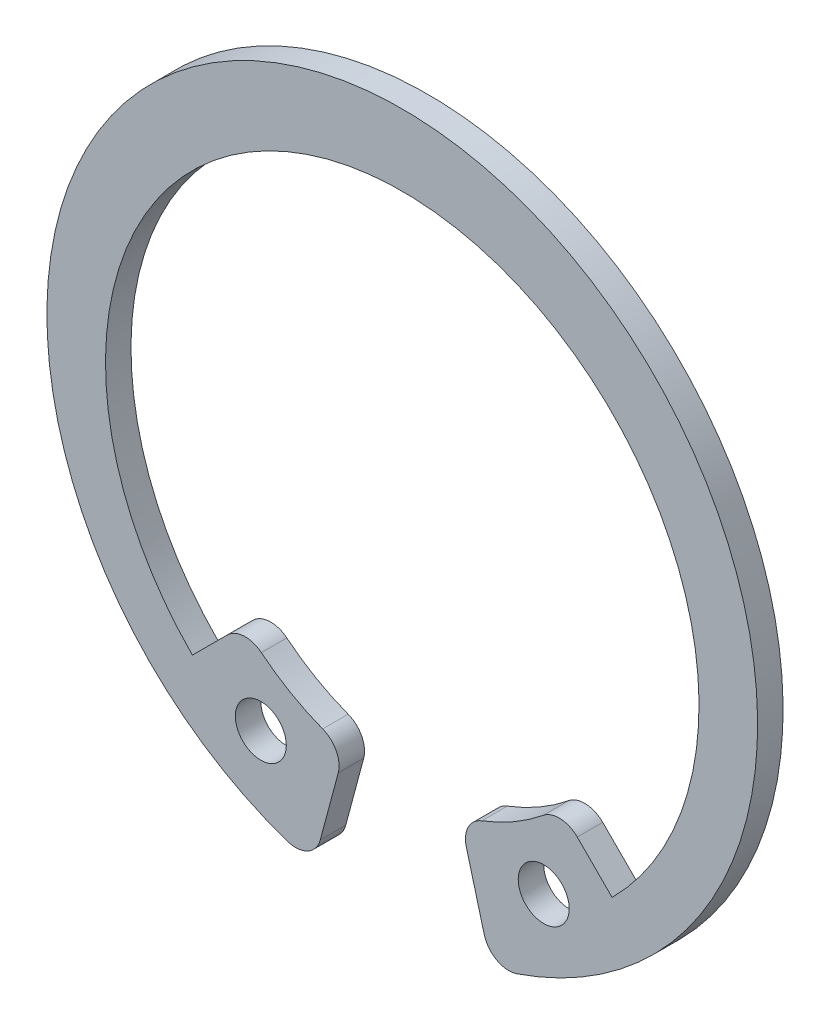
ISO-10303-21;
HEADER;
FILE_DESCRIPTION(('STEP AP214'),'2;1');
FILE_NAME('part.step','',(''),(''),'','','');
FILE_SCHEMA(('AUTOMOTIVE_DESIGN { 1 0 10303 214 1 1 1 1 }'));
ENDSEC;
DATA;
#1=APPLICATION_CONTEXT('core data for automotive mechanical design processes');
#2=APPLICATION_PROTOCOL_DEFINITION('international standard','automotive_design',2000,#1);
#3=PRODUCT_CONTEXT('',#1,'mechanical');
#4=PRODUCT('Part','Part','',(#3));
#5=PRODUCT_RELATED_PRODUCT_CATEGORY('part','',(#4));
#6=PRODUCT_DEFINITION_FORMATION('','',#4);
#7=PRODUCT_DEFINITION_CONTEXT('part definition',#1,'design');
#8=PRODUCT_DEFINITION('design','',#6,#7);
#9=PRODUCT_DEFINITION_SHAPE('','',#8);
#10=(LENGTH_UNIT() NAMED_UNIT(*) SI_UNIT(.MILLI.,.METRE.));
#11=(NAMED_UNIT(*) PLANE_ANGLE_UNIT() SI_UNIT($,.RADIAN.));
#12=(NAMED_UNIT(*) SI_UNIT($,.STERADIAN.) SOLID_ANGLE_UNIT());
#13=UNCERTAINTY_MEASURE_WITH_UNIT(LENGTH_MEASURE(1.E-05),#10,'distance_accuracy_value','');
#14=(GEOMETRIC_REPRESENTATION_CONTEXT(3) GLOBAL_UNCERTAINTY_ASSIGNED_CONTEXT((#13)) GLOBAL_UNIT_ASSIGNED_CONTEXT((#10,
#11,#12)) REPRESENTATION_CONTEXT('',''));
#15=CARTESIAN_POINT('',(0.,0.,0.));
#16=DIRECTION('',(0.,0.,1.));
#17=DIRECTION('',(1.,0.,0.));
#18=AXIS2_PLACEMENT_3D('',#15,#16,#17);
#19=CARTESIAN_POINT('',(6.16251068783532,-7.57672425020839,1.));
#20=DIRECTION('',(0.,0.,-1.));
#21=DIRECTION('',(-1.,0.,0.));
#22=AXIS2_PLACEMENT_3D('',#19,#20,#21);
#23=PLANE('',#22);
#24=CARTESIAN_POINT('',(-5.55229164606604,-9.468398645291,1.));
#25=DIRECTION('',(0.,0.,1.));
#26=DIRECTION('',(1.,0.,0.));
#27=AXIS2_PLACEMENT_3D('',#24,#25,#26);
#28=CIRCLE('',#27,1.);
#29=CARTESIAN_POINT('',(-4.55229164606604,-9.468398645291,1.));
#30=VERTEX_POINT('',#29);
#31=EDGE_CURVE('E468',#30,#30,#28,.T.);
#32=ORIENTED_EDGE('',*,*,#31,.F.);
#33=EDGE_LOOP('',(#32));
#34=FACE_BOUND('',#33,.T.);
#35=CARTESIAN_POINT('',(6.16251068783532,-7.57672425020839,1.));
#36=DIRECTION('',(0.,0.,1.));
#37=DIRECTION('',(-1.,0.,0.));
#38=AXIS2_PLACEMENT_3D('',#35,#36,#37);
#39=CIRCLE('',#38,0.999999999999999);
#40=CARTESIAN_POINT('',(6.86961746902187,-6.86961746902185,1.));
#41=VERTEX_POINT('',#40);
#42=CARTESIAN_POINT('',(5.53152204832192,-6.80093217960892,1.));
#43=VERTEX_POINT('',#42);
#44=EDGE_CURVE('E498',#41,#43,#39,.T.);
#45=ORIENTED_EDGE('',*,*,#44,.T.);
#46=CARTESIAN_POINT('',(0.,0.,1.));
#47=DIRECTION('',(0.,0.,-1.));
#48=DIRECTION('',(1.,0.,0.));
#49=AXIS2_PLACEMENT_3D('',#46,#47,#48);
#50=CIRCLE('',#49,8.76643682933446);
#51=CARTESIAN_POINT('',(3.12401901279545,-8.19090470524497,1.));
#52=VERTEX_POINT('',#51);
#53=EDGE_CURVE('E463',#43,#52,#50,.T.);
#54=ORIENTED_EDGE('',*,*,#53,.T.);
#55=CARTESIAN_POINT('',(3.48038033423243,-9.1252529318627,1.));
#56=DIRECTION('',(0.,0.,1.));
#57=DIRECTION('',(-1.,0.,0.));
#58=AXIS2_PLACEMENT_3D('',#55,#56,#57);
#59=CIRCLE('',#58,1.);
#60=CARTESIAN_POINT('',(2.51445450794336,-9.38407197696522,1.));
#61=VERTEX_POINT('',#60);
#62=EDGE_CURVE('E501',#52,#61,#59,.T.);
#63=ORIENTED_EDGE('',*,*,#62,.T.);
#64=DIRECTION('',(0.258819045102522,-0.965925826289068,0.));
#65=VECTOR('',#64,1.);
#66=CARTESIAN_POINT('',(3.21912407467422,-12.0139346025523,1.));
#67=LINE('',#66,#65);
#68=CARTESIAN_POINT('',(3.21912407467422,-12.0139346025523,1.));
#69=VERTEX_POINT('',#68);
#70=EDGE_CURVE('E503',#61,#69,#67,.T.);
#71=ORIENTED_EDGE('',*,*,#70,.T.);
#72=CARTESIAN_POINT('',(4.18504990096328,-11.7551155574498,1.));
#73=DIRECTION('',(0.,0.,1.));
#74=DIRECTION('',(-1.,0.,0.));
#75=AXIS2_PLACEMENT_3D('',#72,#73,#74);
#76=CIRCLE('',#75,1.);
#77=CARTESIAN_POINT('',(4.50821977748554,-12.701456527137,1.));
#78=VERTEX_POINT('',#77);
#79=EDGE_CURVE('E505',#69,#78,#76,.T.);
#80=ORIENTED_EDGE('',*,*,#79,.T.);
#81=CARTESIAN_POINT('',(0.,0.5,1.));
#82=DIRECTION('',(0.,0.,1.));
#83=DIRECTION('',(1.,0.,0.));
#84=AXIS2_PLACEMENT_3D('',#81,#82,#83);
#85=CIRCLE('',#84,13.95);
#86=CARTESIAN_POINT('',(-4.50821977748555,-12.701456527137,1.));
#87=VERTEX_POINT('',#86);
#88=EDGE_CURVE('E507',#78,#87,#85,.T.);
#89=ORIENTED_EDGE('',*,*,#88,.T.);
#90=CARTESIAN_POINT('',(-4.18504990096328,-11.7551155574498,1.));
#91=DIRECTION('',(0.,0.,1.));
#92=DIRECTION('',(1.,0.,0.));
#93=AXIS2_PLACEMENT_3D('',#90,#91,#92);
#94=CIRCLE('',#93,1.);
#95=CARTESIAN_POINT('',(-3.21912407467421,-12.0139346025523,1.));
#96=VERTEX_POINT('',#95);
#97=EDGE_CURVE('E509',#87,#96,#94,.T.);
#98=ORIENTED_EDGE('',*,*,#97,.T.);
#99=DIRECTION('',(0.258819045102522,0.965925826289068,0.));
#100=VECTOR('',#99,1.);
#101=CARTESIAN_POINT('',(-3.21912407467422,-12.0139346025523,1.));
#102=LINE('',#101,#100);
#103=CARTESIAN_POINT('',(-2.51445450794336,-9.38407197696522,1.));
#104=VERTEX_POINT('',#103);
#105=EDGE_CURVE('E511',#96,#104,#102,.T.);
#106=ORIENTED_EDGE('',*,*,#105,.T.);
#107=CARTESIAN_POINT('',(-3.48038033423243,-9.1252529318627,1.));
#108=DIRECTION('',(0.,0.,1.));
#109=DIRECTION('',(1.,0.,0.));
#110=AXIS2_PLACEMENT_3D('',#107,#108,#109);
#111=CIRCLE('',#110,1.);
#112=CARTESIAN_POINT('',(-3.12401901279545,-8.19090470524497,1.));
#113=VERTEX_POINT('',#112);
#114=EDGE_CURVE('E513',#104,#113,#111,.T.);
#115=ORIENTED_EDGE('',*,*,#114,.T.);
#116=CARTESIAN_POINT('',(0.,0.,1.));
#117=DIRECTION('',(0.,0.,-1.));
#118=DIRECTION('',(1.,0.,0.));
#119=AXIS2_PLACEMENT_3D('',#116,#117,#118);
#120=CIRCLE('',#119,8.76643682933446);
#121=CARTESIAN_POINT('',(-5.53152204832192,-6.80093217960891,1.));
#122=VERTEX_POINT('',#121);
#123=EDGE_CURVE('E515',#113,#122,#120,.T.);
#124=ORIENTED_EDGE('',*,*,#123,.T.);
#125=CARTESIAN_POINT('',(-6.16251068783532,-7.57672425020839,1.));
#126=DIRECTION('',(0.,0.,1.));
#127=DIRECTION('',(-1.,0.,0.));
#128=AXIS2_PLACEMENT_3D('',#125,#126,#127);
#129=CIRCLE('',#128,0.999999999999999);
#130=CARTESIAN_POINT('',(-6.86961746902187,-6.86961746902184,1.));
#131=VERTEX_POINT('',#130);
#132=EDGE_CURVE('E517',#122,#131,#129,.T.);
#133=ORIENTED_EDGE('',*,*,#132,.T.);
#134=DIRECTION('',(-0.70710678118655,-0.707106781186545,0.));
#135=VECTOR('',#134,1.);
#136=CARTESIAN_POINT('',(-6.86961746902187,-6.86961746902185,1.));
#137=LINE('',#136,#135);
#138=CARTESIAN_POINT('',(-8.2377940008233,-8.23779400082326,1.));
#139=VERTEX_POINT('',#138);
#140=EDGE_CURVE('E519',#131,#139,#137,.T.);
#141=ORIENTED_EDGE('',*,*,#140,.T.);
#142=CARTESIAN_POINT('',(0.,0.,1.));
#143=DIRECTION('',(0.,0.,-1.));
#144=DIRECTION('',(1.,0.,0.));
#145=AXIS2_PLACEMENT_3D('',#142,#143,#144);
#146=CIRCLE('',#145,11.65);
#147=CARTESIAN_POINT('',(8.23779400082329,-8.23779400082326,1.));
#148=VERTEX_POINT('',#147);
#149=EDGE_CURVE('E368',#139,#148,#146,.T.);
#150=ORIENTED_EDGE('',*,*,#149,.T.);
#151=DIRECTION('',(-0.70710678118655,0.707106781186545,0.));
#152=VECTOR('',#151,1.);
#153=CARTESIAN_POINT('',(6.86961746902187,-6.86961746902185,1.));
#154=LINE('',#153,#152);
#155=EDGE_CURVE('E363',#148,#41,#154,.T.);
#156=ORIENTED_EDGE('',*,*,#155,.T.);
#157=EDGE_LOOP('',(#45,#54,#63,#71,#80,#89,#98,#106,#115,#124,#133,#141,#150,#156));
#158=FACE_BOUND('',#157,.T.);
#159=CARTESIAN_POINT('',(5.55229164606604,-9.468398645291,1.));
#160=DIRECTION('',(0.,0.,1.));
#161=DIRECTION('',(-1.,0.,0.));
#162=AXIS2_PLACEMENT_3D('',#159,#160,#161);
#163=CIRCLE('',#162,1.);
#164=CARTESIAN_POINT('',(4.55229164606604,-9.468398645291,1.));
#165=VERTEX_POINT('',#164);
#166=EDGE_CURVE('E638',#165,#165,#163,.T.);
#167=ORIENTED_EDGE('',*,*,#166,.F.);
#168=EDGE_LOOP('',(#167));
#169=FACE_BOUND('',#168,.T.);
#170=ADVANCED_FACE('F348',(#34,#158,#169),#23,.F.);
#171=CARTESIAN_POINT('',(6.16251068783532,-7.57672425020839,0.));
#172=DIRECTION('',(0.,0.,-1.));
#173=DIRECTION('',(-1.,0.,0.));
#174=AXIS2_PLACEMENT_3D('',#171,#172,#173);
#175=PLANE('',#174);
#176=CARTESIAN_POINT('',(-5.55229164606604,-9.468398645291,0.));
#177=DIRECTION('',(0.,0.,1.));
#178=DIRECTION('',(1.,0.,0.));
#179=AXIS2_PLACEMENT_3D('',#176,#177,#178);
#180=CIRCLE('',#179,1.);
#181=CARTESIAN_POINT('',(-4.55229164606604,-9.468398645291,0.));
#182=VERTEX_POINT('',#181);
#183=EDGE_CURVE('E471',#182,#182,#180,.T.);
#184=ORIENTED_EDGE('',*,*,#183,.T.);
#185=EDGE_LOOP('',(#184));
#186=FACE_BOUND('',#185,.T.);
#187=CARTESIAN_POINT('',(6.16251068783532,-7.57672425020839,0.));
#188=DIRECTION('',(0.,0.,1.));
#189=DIRECTION('',(-1.,0.,0.));
#190=AXIS2_PLACEMENT_3D('',#187,#188,#189);
#191=CIRCLE('',#190,0.999999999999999);
#192=CARTESIAN_POINT('',(6.86961746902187,-6.86961746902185,0.));
#193=VERTEX_POINT('',#192);
#194=CARTESIAN_POINT('',(5.53152204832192,-6.80093217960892,0.));
#195=VERTEX_POINT('',#194);
#196=EDGE_CURVE('E454',#193,#195,#191,.T.);
#197=ORIENTED_EDGE('',*,*,#196,.F.);
#198=DIRECTION('',(-0.70710678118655,0.707106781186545,0.));
#199=VECTOR('',#198,1.);
#200=CARTESIAN_POINT('',(6.86961746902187,-6.86961746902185,0.));
#201=LINE('',#200,#199);
#202=CARTESIAN_POINT('',(8.23779400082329,-8.23779400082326,0.));
#203=VERTEX_POINT('',#202);
#204=EDGE_CURVE('E496',#203,#193,#201,.T.);
#205=ORIENTED_EDGE('',*,*,#204,.F.);
#206=CARTESIAN_POINT('',(0.,0.,0.));
#207=DIRECTION('',(0.,0.,-1.));
#208=DIRECTION('',(1.,0.,0.));
#209=AXIS2_PLACEMENT_3D('',#206,#207,#208);
#210=CIRCLE('',#209,11.65);
#211=CARTESIAN_POINT('',(-8.2377940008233,-8.23779400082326,0.));
#212=VERTEX_POINT('',#211);
#213=EDGE_CURVE('E494',#212,#203,#210,.T.);
#214=ORIENTED_EDGE('',*,*,#213,.F.);
#215=DIRECTION('',(-0.70710678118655,-0.707106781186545,0.));
#216=VECTOR('',#215,1.);
#217=CARTESIAN_POINT('',(-6.86961746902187,-6.86961746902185,0.));
#218=LINE('',#217,#216);
#219=CARTESIAN_POINT('',(-6.86961746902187,-6.86961746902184,0.));
#220=VERTEX_POINT('',#219);
#221=EDGE_CURVE('E492',#220,#212,#218,.T.);
#222=ORIENTED_EDGE('',*,*,#221,.F.);
#223=CARTESIAN_POINT('',(-6.16251068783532,-7.57672425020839,0.));
#224=DIRECTION('',(0.,0.,1.));
#225=DIRECTION('',(-1.,0.,0.));
#226=AXIS2_PLACEMENT_3D('',#223,#224,#225);
#227=CIRCLE('',#226,0.999999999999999);
#228=CARTESIAN_POINT('',(-5.53152204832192,-6.80093217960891,0.));
#229=VERTEX_POINT('',#228);
#230=EDGE_CURVE('E490',#229,#220,#227,.T.);
#231=ORIENTED_EDGE('',*,*,#230,.F.);
#232=CARTESIAN_POINT('',(0.,0.,0.));
#233=DIRECTION('',(0.,0.,-1.));
#234=DIRECTION('',(1.,0.,0.));
#235=AXIS2_PLACEMENT_3D('',#232,#233,#234);
#236=CIRCLE('',#235,8.76643682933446);
#237=CARTESIAN_POINT('',(-3.12401901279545,-8.19090470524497,0.));
#238=VERTEX_POINT('',#237);
#239=EDGE_CURVE('E488',#238,#229,#236,.T.);
#240=ORIENTED_EDGE('',*,*,#239,.F.);
#241=CARTESIAN_POINT('',(-3.48038033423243,-9.1252529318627,0.));
#242=DIRECTION('',(0.,0.,1.));
#243=DIRECTION('',(1.,0.,0.));
#244=AXIS2_PLACEMENT_3D('',#241,#242,#243);
#245=CIRCLE('',#244,1.);
#246=CARTESIAN_POINT('',(-2.51445450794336,-9.38407197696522,0.));
#247=VERTEX_POINT('',#246);
#248=EDGE_CURVE('E486',#247,#238,#245,.T.);
#249=ORIENTED_EDGE('',*,*,#248,.F.);
#250=DIRECTION('',(0.258819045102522,0.965925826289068,0.));
#251=VECTOR('',#250,1.);
#252=CARTESIAN_POINT('',(-3.21912407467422,-12.0139346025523,0.));
#253=LINE('',#252,#251);
#254=CARTESIAN_POINT('',(-3.21912407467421,-12.0139346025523,0.));
#255=VERTEX_POINT('',#254);
#256=EDGE_CURVE('E484',#255,#247,#253,.T.);
#257=ORIENTED_EDGE('',*,*,#256,.F.);
#258=CARTESIAN_POINT('',(-4.18504990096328,-11.7551155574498,0.));
#259=DIRECTION('',(0.,0.,1.));
#260=DIRECTION('',(1.,0.,0.));
#261=AXIS2_PLACEMENT_3D('',#258,#259,#260);
#262=CIRCLE('',#261,1.);
#263=CARTESIAN_POINT('',(-4.50821977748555,-12.701456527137,0.));
#264=VERTEX_POINT('',#263);
#265=EDGE_CURVE('E482',#264,#255,#262,.T.);
#266=ORIENTED_EDGE('',*,*,#265,.F.);
#267=CARTESIAN_POINT('',(0.,0.5,0.));
#268=DIRECTION('',(0.,0.,1.));
#269=DIRECTION('',(1.,0.,0.));
#270=AXIS2_PLACEMENT_3D('',#267,#268,#269);
#271=CIRCLE('',#270,13.95);
#272=CARTESIAN_POINT('',(4.50821977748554,-12.701456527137,0.));
#273=VERTEX_POINT('',#272);
#274=EDGE_CURVE('E480',#273,#264,#271,.T.);
#275=ORIENTED_EDGE('',*,*,#274,.F.);
#276=CARTESIAN_POINT('',(4.18504990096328,-11.7551155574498,0.));
#277=DIRECTION('',(0.,0.,1.));
#278=DIRECTION('',(-1.,0.,0.));
#279=AXIS2_PLACEMENT_3D('',#276,#277,#278);
#280=CIRCLE('',#279,1.);
#281=CARTESIAN_POINT('',(3.21912407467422,-12.0139346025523,0.));
#282=VERTEX_POINT('',#281);
#283=EDGE_CURVE('E478',#282,#273,#280,.T.);
#284=ORIENTED_EDGE('',*,*,#283,.F.);
#285=DIRECTION('',(0.258819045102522,-0.965925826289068,0.));
#286=VECTOR('',#285,1.);
#287=CARTESIAN_POINT('',(3.21912407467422,-12.0139346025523,0.));
#288=LINE('',#287,#286);
#289=CARTESIAN_POINT('',(2.51445450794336,-9.38407197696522,0.));
#290=VERTEX_POINT('',#289);
#291=EDGE_CURVE('E476',#290,#282,#288,.T.);
#292=ORIENTED_EDGE('',*,*,#291,.F.);
#293=CARTESIAN_POINT('',(3.48038033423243,-9.1252529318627,0.));
#294=DIRECTION('',(0.,0.,1.));
#295=DIRECTION('',(-1.,0.,0.));
#296=AXIS2_PLACEMENT_3D('',#293,#294,#295);
#297=CIRCLE('',#296,1.);
#298=CARTESIAN_POINT('',(3.12401901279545,-8.19090470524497,0.));
#299=VERTEX_POINT('',#298);
#300=EDGE_CURVE('E456',#299,#290,#297,.T.);
#301=ORIENTED_EDGE('',*,*,#300,.F.);
#302=CARTESIAN_POINT('',(0.,0.,0.));
#303=DIRECTION('',(0.,0.,-1.));
#304=DIRECTION('',(1.,0.,0.));
#305=AXIS2_PLACEMENT_3D('',#302,#303,#304);
#306=CIRCLE('',#305,8.76643682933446);
#307=EDGE_CURVE('E449',#195,#299,#306,.T.);
#308=ORIENTED_EDGE('',*,*,#307,.F.);
#309=EDGE_LOOP('',(#197,#205,#214,#222,#231,#240,#249,#257,#266,#275,#284,#292,#301,#308));
#310=FACE_BOUND('',#309,.T.);
#311=CARTESIAN_POINT('',(5.55229164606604,-9.468398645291,0.));
#312=DIRECTION('',(0.,0.,1.));
#313=DIRECTION('',(-1.,0.,0.));
#314=AXIS2_PLACEMENT_3D('',#311,#312,#313);
#315=CIRCLE('',#314,1.);
#316=CARTESIAN_POINT('',(4.55229164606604,-9.468398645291,0.));
#317=VERTEX_POINT('',#316);
#318=EDGE_CURVE('E641',#317,#317,#315,.T.);
#319=ORIENTED_EDGE('',*,*,#318,.T.);
#320=EDGE_LOOP('',(#319));
#321=FACE_BOUND('',#320,.T.);
#322=ADVANCED_FACE('F450',(#186,#310,#321),#175,.T.);
#323=CARTESIAN_POINT('',(6.16251068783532,-7.57672425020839,1.));
#324=DIRECTION('',(0.,0.,-1.));
#325=DIRECTION('',(-1.,0.,0.));
#326=AXIS2_PLACEMENT_3D('',#323,#324,#325);
#327=CYLINDRICAL_SURFACE('',#326,0.999999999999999);
#328=ORIENTED_EDGE('',*,*,#196,.T.);
#329=DIRECTION('',(0.,0.,-1.));
#330=VECTOR('',#329,1.);
#331=CARTESIAN_POINT('',(5.53152204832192,-6.80093217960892,1.));
#332=LINE('',#331,#330);
#333=EDGE_CURVE('E11',#43,#195,#332,.T.);
#334=ORIENTED_EDGE('',*,*,#333,.F.);
#335=ORIENTED_EDGE('',*,*,#44,.F.);
#336=DIRECTION('',(0.,0.,-1.));
#337=VECTOR('',#336,1.);
#338=CARTESIAN_POINT('',(6.86961746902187,-6.86961746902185,1.));
#339=LINE('',#338,#337);
#340=EDGE_CURVE('E467',#41,#193,#339,.T.);
#341=ORIENTED_EDGE('',*,*,#340,.T.);
#342=EDGE_LOOP('',(#328,#334,#335,#341));
#343=FACE_BOUND('',#342,.T.);
#344=ADVANCED_FACE('F350',(#343),#327,.T.);
#345=CARTESIAN_POINT('',(0.,0.,1.));
#346=DIRECTION('',(0.,0.,-1.));
#347=DIRECTION('',(-1.,0.,0.));
#348=AXIS2_PLACEMENT_3D('',#345,#346,#347);
#349=CYLINDRICAL_SURFACE('',#348,8.76643682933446);
#350=ORIENTED_EDGE('',*,*,#307,.T.);
#351=DIRECTION('',(0.,0.,-1.));
#352=VECTOR('',#351,1.);
#353=CARTESIAN_POINT('',(3.12401901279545,-8.19090470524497,1.));
#354=LINE('',#353,#352);
#355=EDGE_CURVE('E356',#52,#299,#354,.T.);
#356=ORIENTED_EDGE('',*,*,#355,.F.);
#357=ORIENTED_EDGE('',*,*,#53,.F.);
#358=ORIENTED_EDGE('',*,*,#333,.T.);
#359=EDGE_LOOP('',(#350,#356,#357,#358));
#360=FACE_BOUND('',#359,.T.);
#361=ADVANCED_FACE('F462',(#360),#349,.F.);
#362=CARTESIAN_POINT('',(3.48038033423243,-9.1252529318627,1.));
#363=DIRECTION('',(0.,0.,-1.));
#364=DIRECTION('',(-1.,0.,0.));
#365=AXIS2_PLACEMENT_3D('',#362,#363,#364);
#366=CYLINDRICAL_SURFACE('',#365,1.);
#367=ORIENTED_EDGE('',*,*,#300,.T.);
#368=DIRECTION('',(0.,0.,-1.));
#369=VECTOR('',#368,1.);
#370=CARTESIAN_POINT('',(2.51445450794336,-9.38407197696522,1.));
#371=LINE('',#370,#369);
#372=EDGE_CURVE('E554',#61,#290,#371,.T.);
#373=ORIENTED_EDGE('',*,*,#372,.F.);
#374=ORIENTED_EDGE('',*,*,#62,.F.);
#375=ORIENTED_EDGE('',*,*,#355,.T.);
#376=EDGE_LOOP('',(#367,#373,#374,#375));
#377=FACE_BOUND('',#376,.T.);
#378=ADVANCED_FACE('F558',(#377),#366,.T.);
#379=CARTESIAN_POINT('',(3.21912407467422,-12.0139346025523,1.));
#380=DIRECTION('',(0.965925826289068,0.258819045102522,0.));
#381=DIRECTION('',(-0.258819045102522,0.965925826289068,0.));
#382=AXIS2_PLACEMENT_3D('',#379,#380,#381);
#383=PLANE('',#382);
#384=ORIENTED_EDGE('',*,*,#291,.T.);
#385=DIRECTION('',(0.,0.,-1.));
#386=VECTOR('',#385,1.);
#387=CARTESIAN_POINT('',(3.21912407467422,-12.0139346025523,1.));
#388=LINE('',#387,#386);
#389=EDGE_CURVE('E551',#69,#282,#388,.T.);
#390=ORIENTED_EDGE('',*,*,#389,.F.);
#391=ORIENTED_EDGE('',*,*,#70,.F.);
#392=ORIENTED_EDGE('',*,*,#372,.T.);
#393=EDGE_LOOP('',(#384,#390,#391,#392));
#394=FACE_BOUND('',#393,.T.);
#395=ADVANCED_FACE('F566',(#394),#383,.F.);
#396=CARTESIAN_POINT('',(4.18504990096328,-11.7551155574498,1.));
#397=DIRECTION('',(0.,0.,-1.));
#398=DIRECTION('',(-1.,0.,0.));
#399=AXIS2_PLACEMENT_3D('',#396,#397,#398);
#400=CYLINDRICAL_SURFACE('',#399,1.);
#401=ORIENTED_EDGE('',*,*,#283,.T.);
#402=DIRECTION('',(0.,0.,-1.));
#403=VECTOR('',#402,1.);
#404=CARTESIAN_POINT('',(4.50821977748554,-12.701456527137,1.));
#405=LINE('',#404,#403);
#406=EDGE_CURVE('E548',#78,#273,#405,.T.);
#407=ORIENTED_EDGE('',*,*,#406,.F.);
#408=ORIENTED_EDGE('',*,*,#79,.F.);
#409=ORIENTED_EDGE('',*,*,#389,.T.);
#410=EDGE_LOOP('',(#401,#407,#408,#409));
#411=FACE_BOUND('',#410,.T.);
#412=ADVANCED_FACE('F569',(#411),#400,.T.);
#413=CARTESIAN_POINT('',(0.,0.5,1.));
#414=DIRECTION('',(0.,0.,-1.));
#415=DIRECTION('',(-1.,0.,0.));
#416=AXIS2_PLACEMENT_3D('',#413,#414,#415);
#417=CYLINDRICAL_SURFACE('',#416,13.95);
#418=ORIENTED_EDGE('',*,*,#274,.T.);
#419=DIRECTION('',(0.,0.,-1.));
#420=VECTOR('',#419,1.);
#421=CARTESIAN_POINT('',(-4.50821977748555,-12.701456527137,1.));
#422=LINE('',#421,#420);
#423=EDGE_CURVE('E545',#87,#264,#422,.T.);
#424=ORIENTED_EDGE('',*,*,#423,.F.);
#425=ORIENTED_EDGE('',*,*,#88,.F.);
#426=ORIENTED_EDGE('',*,*,#406,.T.);
#427=EDGE_LOOP('',(#418,#424,#425,#426));
#428=FACE_BOUND('',#427,.T.);
#429=ADVANCED_FACE('F574',(#428),#417,.T.);
#430=CARTESIAN_POINT('',(-4.18504990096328,-11.7551155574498,1.));
#431=DIRECTION('',(0.,0.,-1.));
#432=DIRECTION('',(-1.,0.,0.));
#433=AXIS2_PLACEMENT_3D('',#430,#431,#432);
#434=CYLINDRICAL_SURFACE('',#433,1.);
#435=ORIENTED_EDGE('',*,*,#265,.T.);
#436=DIRECTION('',(0.,0.,-1.));
#437=VECTOR('',#436,1.);
#438=CARTESIAN_POINT('',(-3.21912407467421,-12.0139346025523,1.));
#439=LINE('',#438,#437);
#440=EDGE_CURVE('E542',#96,#255,#439,.T.);
#441=ORIENTED_EDGE('',*,*,#440,.F.);
#442=ORIENTED_EDGE('',*,*,#97,.F.);
#443=ORIENTED_EDGE('',*,*,#423,.T.);
#444=EDGE_LOOP('',(#435,#441,#442,#443));
#445=FACE_BOUND('',#444,.T.);
#446=ADVANCED_FACE('F580',(#445),#434,.T.);
#447=CARTESIAN_POINT('',(-3.21912407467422,-12.0139346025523,1.));
#448=DIRECTION('',(-0.965925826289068,0.258819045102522,0.));
#449=DIRECTION('',(-0.258819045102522,-0.965925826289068,0.));
#450=AXIS2_PLACEMENT_3D('',#447,#448,#449);
#451=PLANE('',#450);
#452=ORIENTED_EDGE('',*,*,#256,.T.);
#453=DIRECTION('',(0.,0.,-1.));
#454=VECTOR('',#453,1.);
#455=CARTESIAN_POINT('',(-2.51445450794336,-9.38407197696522,1.));
#456=LINE('',#455,#454);
#457=EDGE_CURVE('E539',#104,#247,#456,.T.);
#458=ORIENTED_EDGE('',*,*,#457,.F.);
#459=ORIENTED_EDGE('',*,*,#105,.F.);
#460=ORIENTED_EDGE('',*,*,#440,.T.);
#461=EDGE_LOOP('',(#452,#458,#459,#460));
#462=FACE_BOUND('',#461,.T.);
#463=ADVANCED_FACE('F584',(#462),#451,.F.);
#464=CARTESIAN_POINT('',(-3.48038033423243,-9.1252529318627,1.));
#465=DIRECTION('',(0.,0.,-1.));
#466=DIRECTION('',(-1.,0.,0.));
#467=AXIS2_PLACEMENT_3D('',#464,#465,#466);
#468=CYLINDRICAL_SURFACE('',#467,1.);
#469=ORIENTED_EDGE('',*,*,#248,.T.);
#470=DIRECTION('',(0.,0.,-1.));
#471=VECTOR('',#470,1.);
#472=CARTESIAN_POINT('',(-3.12401901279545,-8.19090470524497,1.));
#473=LINE('',#472,#471);
#474=EDGE_CURVE('E536',#113,#238,#473,.T.);
#475=ORIENTED_EDGE('',*,*,#474,.F.);
#476=ORIENTED_EDGE('',*,*,#114,.F.);
#477=ORIENTED_EDGE('',*,*,#457,.T.);
#478=EDGE_LOOP('',(#469,#475,#476,#477));
#479=FACE_BOUND('',#478,.T.);
#480=ADVANCED_FACE('F589',(#479),#468,.T.);
#481=CARTESIAN_POINT('',(0.,0.,1.));
#482=DIRECTION('',(0.,0.,-1.));
#483=DIRECTION('',(-1.,0.,0.));
#484=AXIS2_PLACEMENT_3D('',#481,#482,#483);
#485=CYLINDRICAL_SURFACE('',#484,8.76643682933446);
#486=ORIENTED_EDGE('',*,*,#239,.T.);
#487=DIRECTION('',(0.,0.,-1.));
#488=VECTOR('',#487,1.);
#489=CARTESIAN_POINT('',(-5.53152204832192,-6.80093217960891,1.));
#490=LINE('',#489,#488);
#491=EDGE_CURVE('E533',#122,#229,#490,.T.);
#492=ORIENTED_EDGE('',*,*,#491,.F.);
#493=ORIENTED_EDGE('',*,*,#123,.F.);
#494=ORIENTED_EDGE('',*,*,#474,.T.);
#495=EDGE_LOOP('',(#486,#492,#493,#494));
#496=FACE_BOUND('',#495,.T.);
#497=ADVANCED_FACE('F595',(#496),#485,.F.);
#498=CARTESIAN_POINT('',(-6.16251068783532,-7.57672425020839,1.));
#499=DIRECTION('',(0.,0.,-1.));
#500=DIRECTION('',(-1.,0.,0.));
#501=AXIS2_PLACEMENT_3D('',#498,#499,#500);
#502=CYLINDRICAL_SURFACE('',#501,0.999999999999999);
#503=ORIENTED_EDGE('',*,*,#230,.T.);
#504=DIRECTION('',(0.,0.,-1.));
#505=VECTOR('',#504,1.);
#506=CARTESIAN_POINT('',(-6.86961746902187,-6.86961746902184,1.));
#507=LINE('',#506,#505);
#508=EDGE_CURVE('E530',#131,#220,#507,.T.);
#509=ORIENTED_EDGE('',*,*,#508,.F.);
#510=ORIENTED_EDGE('',*,*,#132,.F.);
#511=ORIENTED_EDGE('',*,*,#491,.T.);
#512=EDGE_LOOP('',(#503,#509,#510,#511));
#513=FACE_BOUND('',#512,.T.);
#514=ADVANCED_FACE('F599',(#513),#502,.T.);
#515=CARTESIAN_POINT('',(-6.86961746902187,-6.86961746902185,1.));
#516=DIRECTION('',(0.707106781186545,-0.70710678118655,0.));
#517=DIRECTION('',(0.70710678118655,0.707106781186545,0.));
#518=AXIS2_PLACEMENT_3D('',#515,#516,#517);
#519=PLANE('',#518);
#520=ORIENTED_EDGE('',*,*,#221,.T.);
#521=DIRECTION('',(0.,0.,-1.));
#522=VECTOR('',#521,1.);
#523=CARTESIAN_POINT('',(-8.2377940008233,-8.23779400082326,1.));
#524=LINE('',#523,#522);
#525=EDGE_CURVE('E527',#139,#212,#524,.T.);
#526=ORIENTED_EDGE('',*,*,#525,.F.);
#527=ORIENTED_EDGE('',*,*,#140,.F.);
#528=ORIENTED_EDGE('',*,*,#508,.T.);
#529=EDGE_LOOP('',(#520,#526,#527,#528));
#530=FACE_BOUND('',#529,.T.);
#531=ADVANCED_FACE('F604',(#530),#519,.F.);
#532=CARTESIAN_POINT('',(0.,0.,1.));
#533=DIRECTION('',(0.,0.,-1.));
#534=DIRECTION('',(-1.,0.,0.));
#535=AXIS2_PLACEMENT_3D('',#532,#533,#534);
#536=CYLINDRICAL_SURFACE('',#535,11.65);
#537=ORIENTED_EDGE('',*,*,#213,.T.);
#538=DIRECTION('',(0.,0.,-1.));
#539=VECTOR('',#538,1.);
#540=CARTESIAN_POINT('',(8.23779400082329,-8.23779400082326,1.));
#541=LINE('',#540,#539);
#542=EDGE_CURVE('E524',#148,#203,#541,.T.);
#543=ORIENTED_EDGE('',*,*,#542,.F.);
#544=ORIENTED_EDGE('',*,*,#149,.F.);
#545=ORIENTED_EDGE('',*,*,#525,.T.);
#546=EDGE_LOOP('',(#537,#543,#544,#545));
#547=FACE_BOUND('',#546,.T.);
#548=ADVANCED_FACE('F607',(#547),#536,.F.);
#549=CARTESIAN_POINT('',(6.86961746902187,-6.86961746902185,1.));
#550=DIRECTION('',(-0.707106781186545,-0.70710678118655,0.));
#551=DIRECTION('',(0.70710678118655,-0.707106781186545,0.));
#552=AXIS2_PLACEMENT_3D('',#549,#550,#551);
#553=PLANE('',#552);
#554=ORIENTED_EDGE('',*,*,#204,.T.);
#555=ORIENTED_EDGE('',*,*,#340,.F.);
#556=ORIENTED_EDGE('',*,*,#155,.F.);
#557=ORIENTED_EDGE('',*,*,#542,.T.);
#558=EDGE_LOOP('',(#554,#555,#556,#557));
#559=FACE_BOUND('',#558,.T.);
#560=ADVANCED_FACE('F609',(#559),#553,.F.);
#561=CARTESIAN_POINT('',(-5.55229164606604,-9.468398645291,1.));
#562=DIRECTION('',(0.,0.,-1.));
#563=DIRECTION('',(-1.,0.,0.));
#564=AXIS2_PLACEMENT_3D('',#561,#562,#563);
#565=CYLINDRICAL_SURFACE('',#564,1.);
#566=ORIENTED_EDGE('',*,*,#31,.T.);
#567=EDGE_LOOP('',(#566));
#568=FACE_BOUND('',#567,.T.);
#569=ORIENTED_EDGE('',*,*,#183,.F.);
#570=EDGE_LOOP('',(#569));
#571=FACE_BOUND('',#570,.T.);
#572=ADVANCED_FACE('F611',(#568,#571),#565,.F.);
#573=CARTESIAN_POINT('',(5.55229164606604,-9.468398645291,1.));
#574=DIRECTION('',(0.,0.,-1.));
#575=DIRECTION('',(-1.,0.,0.));
#576=AXIS2_PLACEMENT_3D('',#573,#574,#575);
#577=CYLINDRICAL_SURFACE('',#576,1.);
#578=ORIENTED_EDGE('',*,*,#166,.T.);
#579=EDGE_LOOP('',(#578));
#580=FACE_BOUND('',#579,.T.);
#581=ORIENTED_EDGE('',*,*,#318,.F.);
#582=EDGE_LOOP('',(#581));
#583=FACE_BOUND('',#582,.T.);
#584=ADVANCED_FACE('F617',(#580,#583),#577,.F.);
#585=CLOSED_SHELL('',(#170,#322,#344,#361,#378,#395,#412,#429,#446,#463,#480,#497,#514,#531,
#548,#560,#572,#584));
#586=MANIFOLD_SOLID_BREP('B2',#585);
#587=ADVANCED_BREP_SHAPE_REPRESENTATION('',(#18,#586),#14);
#588=SHAPE_DEFINITION_REPRESENTATION(#9,#587);
ENDSEC;
END-ISO-10303-21;
